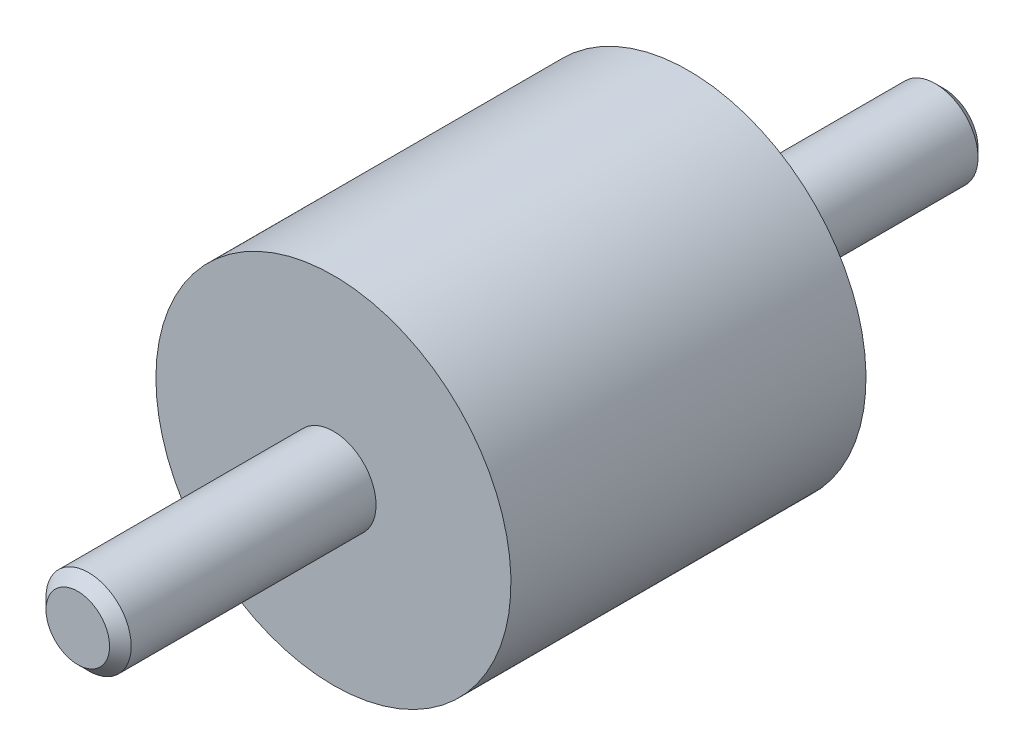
ISO-10303-21;
HEADER;
FILE_DESCRIPTION(('STEP AP214'),'2;1');
FILE_NAME('part.step','',(''),(''),'','','');
FILE_SCHEMA(('AUTOMOTIVE_DESIGN { 1 0 10303 214 1 1 1 1 }'));
ENDSEC;
DATA;
#1=APPLICATION_CONTEXT('core data for automotive mechanical design processes');
#2=APPLICATION_PROTOCOL_DEFINITION('international standard','automotive_design',2000,#1);
#3=PRODUCT_CONTEXT('',#1,'mechanical');
#4=PRODUCT('Part','Part','',(#3));
#5=PRODUCT_RELATED_PRODUCT_CATEGORY('part','',(#4));
#6=PRODUCT_DEFINITION_FORMATION('','',#4);
#7=PRODUCT_DEFINITION_CONTEXT('part definition',#1,'design');
#8=PRODUCT_DEFINITION('design','',#6,#7);
#9=PRODUCT_DEFINITION_SHAPE('','',#8);
#10=(LENGTH_UNIT() NAMED_UNIT(*) SI_UNIT(.MILLI.,.METRE.));
#11=(NAMED_UNIT(*) PLANE_ANGLE_UNIT() SI_UNIT($,.RADIAN.));
#12=(NAMED_UNIT(*) SI_UNIT($,.STERADIAN.) SOLID_ANGLE_UNIT());
#13=UNCERTAINTY_MEASURE_WITH_UNIT(LENGTH_MEASURE(1.E-05),#10,'distance_accuracy_value','');
#14=(GEOMETRIC_REPRESENTATION_CONTEXT(3) GLOBAL_UNCERTAINTY_ASSIGNED_CONTEXT((#13)) GLOBAL_UNIT_ASSIGNED_CONTEXT((#10,
#11,#12)) REPRESENTATION_CONTEXT('',''));
#15=CARTESIAN_POINT('',(0.,0.,0.));
#16=DIRECTION('',(0.,0.,1.));
#17=DIRECTION('',(1.,0.,0.));
#18=AXIS2_PLACEMENT_3D('',#15,#16,#17);
#19=CARTESIAN_POINT('',(0.,0.,0.5));
#20=DIRECTION('',(0.,0.,1.));
#21=DIRECTION('',(0.,-1.,0.));
#22=AXIS2_PLACEMENT_3D('',#19,#20,#21);
#23=CYLINDRICAL_SURFACE('',#22,12.5);
#24=CARTESIAN_POINT('',(0.,0.,0.));
#25=DIRECTION('',(0.,0.,1.));
#26=DIRECTION('',(0.,-1.,0.));
#27=AXIS2_PLACEMENT_3D('',#24,#25,#26);
#28=CIRCLE('',#27,12.5);
#29=CARTESIAN_POINT('',(0.,-12.5,0.));
#30=VERTEX_POINT('',#29);
#31=EDGE_CURVE('E22',#30,#30,#28,.T.);
#32=ORIENTED_EDGE('',*,*,#31,.T.);
#33=EDGE_LOOP('',(#32));
#34=FACE_BOUND('',#33,.T.);
#35=CARTESIAN_POINT('',(0.,0.,25.));
#36=DIRECTION('',(0.,0.,-1.));
#37=DIRECTION('',(-1.,0.,0.));
#38=AXIS2_PLACEMENT_3D('',#35,#36,#37);
#39=CIRCLE('',#38,12.5);
#40=CARTESIAN_POINT('',(-12.5,0.,25.));
#41=VERTEX_POINT('',#40);
#42=EDGE_CURVE('E34',#41,#41,#39,.T.);
#43=ORIENTED_EDGE('',*,*,#42,.T.);
#44=EDGE_LOOP('',(#43));
#45=FACE_BOUND('',#44,.T.);
#46=ADVANCED_FACE('F12',(#34,#45),#23,.T.);
#47=CARTESIAN_POINT('',(12.5,0.,0.));
#48=DIRECTION('',(0.,0.,-1.));
#49=DIRECTION('',(0.,1.,0.));
#50=AXIS2_PLACEMENT_3D('',#47,#48,#49);
#51=PLANE('',#50);
#52=CARTESIAN_POINT('',(0.,0.,0.));
#53=DIRECTION('',(0.,0.,-1.));
#54=DIRECTION('',(0.,1.,0.));
#55=AXIS2_PLACEMENT_3D('',#52,#53,#54);
#56=CIRCLE('',#55,3.);
#57=CARTESIAN_POINT('',(0.,3.,0.));
#58=VERTEX_POINT('',#57);
#59=EDGE_CURVE('E18',#58,#58,#56,.T.);
#60=ORIENTED_EDGE('',*,*,#59,.F.);
#61=EDGE_LOOP('',(#60));
#62=FACE_BOUND('',#61,.T.);
#63=ORIENTED_EDGE('',*,*,#31,.F.);
#64=EDGE_LOOP('',(#63));
#65=FACE_BOUND('',#64,.T.);
#66=ADVANCED_FACE('F57',(#62,#65),#51,.T.);
#67=CARTESIAN_POINT('',(0.,0.,-18.));
#68=DIRECTION('',(0.,0.,1.));
#69=DIRECTION('',(0.,-1.,0.));
#70=AXIS2_PLACEMENT_3D('',#67,#68,#69);
#71=CYLINDRICAL_SURFACE('',#70,3.);
#72=CARTESIAN_POINT('',(0.,0.,-17.3865));
#73=DIRECTION('',(0.,0.,1.));
#74=DIRECTION('',(0.,-1.,0.));
#75=AXIS2_PLACEMENT_3D('',#72,#73,#74);
#76=CIRCLE('',#75,3.);
#77=CARTESIAN_POINT('',(0.,-3.,-17.3865));
#78=VERTEX_POINT('',#77);
#79=EDGE_CURVE('E26',#78,#78,#76,.T.);
#80=ORIENTED_EDGE('',*,*,#79,.T.);
#81=EDGE_LOOP('',(#80));
#82=FACE_BOUND('',#81,.T.);
#83=ORIENTED_EDGE('',*,*,#59,.T.);
#84=EDGE_LOOP('',(#83));
#85=FACE_BOUND('',#84,.T.);
#86=ADVANCED_FACE('F62',(#82,#85),#71,.T.);
#87=CARTESIAN_POINT('',(0.,0.,-17.3865));
#88=DIRECTION('',(0.,0.,1.));
#89=DIRECTION('',(0.,-1.,0.));
#90=AXIS2_PLACEMENT_3D('',#87,#88,#89);
#91=CONICAL_SURFACE('',#90,3.,0.785398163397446);
#92=CARTESIAN_POINT('',(0.,0.,-18.));
#93=DIRECTION('',(0.,0.,1.));
#94=DIRECTION('',(0.,-1.,0.));
#95=AXIS2_PLACEMENT_3D('',#92,#93,#94);
#96=CIRCLE('',#95,2.3865);
#97=CARTESIAN_POINT('',(0.,-2.3865,-18.));
#98=VERTEX_POINT('',#97);
#99=EDGE_CURVE('E31',#98,#98,#96,.T.);
#100=ORIENTED_EDGE('',*,*,#99,.T.);
#101=EDGE_LOOP('',(#100));
#102=FACE_BOUND('',#101,.T.);
#103=ORIENTED_EDGE('',*,*,#79,.F.);
#104=EDGE_LOOP('',(#103));
#105=FACE_BOUND('',#104,.T.);
#106=ADVANCED_FACE('F78',(#102,#105),#91,.T.);
#107=CARTESIAN_POINT('',(2.3865,0.,-18.));
#108=DIRECTION('',(0.,0.,-1.));
#109=DIRECTION('',(0.,1.,0.));
#110=AXIS2_PLACEMENT_3D('',#107,#108,#109);
#111=PLANE('',#110);
#112=ORIENTED_EDGE('',*,*,#99,.F.);
#113=EDGE_LOOP('',(#112));
#114=FACE_BOUND('',#113,.T.);
#115=ADVANCED_FACE('F70',(#114),#111,.T.);
#116=CARTESIAN_POINT('',(0.,12.5,25.));
#117=DIRECTION('',(0.,0.,1.));
#118=DIRECTION('',(1.,0.,0.));
#119=AXIS2_PLACEMENT_3D('',#116,#117,#118);
#120=PLANE('',#119);
#121=CARTESIAN_POINT('',(0.,0.,25.));
#122=DIRECTION('',(0.,0.,1.));
#123=DIRECTION('',(1.,0.,0.));
#124=AXIS2_PLACEMENT_3D('',#121,#122,#123);
#125=CIRCLE('',#124,3.);
#126=CARTESIAN_POINT('',(3.,0.,25.));
#127=VERTEX_POINT('',#126);
#128=EDGE_CURVE('E8',#127,#127,#125,.F.);
#129=ORIENTED_EDGE('',*,*,#128,.T.);
#130=EDGE_LOOP('',(#129));
#131=FACE_BOUND('',#130,.T.);
#132=ORIENTED_EDGE('',*,*,#42,.F.);
#133=EDGE_LOOP('',(#132));
#134=FACE_BOUND('',#133,.T.);
#135=ADVANCED_FACE('F68',(#131,#134),#120,.T.);
#136=CARTESIAN_POINT('',(0.,0.,15.));
#137=DIRECTION('',(0.,0.,1.));
#138=DIRECTION('',(0.,-1.,0.));
#139=AXIS2_PLACEMENT_3D('',#136,#137,#138);
#140=CYLINDRICAL_SURFACE('',#139,3.);
#141=ORIENTED_EDGE('',*,*,#128,.F.);
#142=EDGE_LOOP('',(#141));
#143=FACE_BOUND('',#142,.T.);
#144=CARTESIAN_POINT('',(0.,0.,42.2385265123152));
#145=DIRECTION('',(0.,0.,-1.));
#146=DIRECTION('',(-1.,0.,0.));
#147=AXIS2_PLACEMENT_3D('',#144,#145,#146);
#148=CIRCLE('',#147,3.);
#149=CARTESIAN_POINT('',(-3.,0.,42.2385265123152));
#150=VERTEX_POINT('',#149);
#151=EDGE_CURVE('E37',#150,#150,#148,.T.);
#152=ORIENTED_EDGE('',*,*,#151,.T.);
#153=EDGE_LOOP('',(#152));
#154=FACE_BOUND('',#153,.T.);
#155=ADVANCED_FACE('F54',(#143,#154),#140,.T.);
#156=CARTESIAN_POINT('',(0.,0.,42.2385265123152));
#157=DIRECTION('',(0.,0.,-1.));
#158=DIRECTION('',(-1.,0.,0.));
#159=AXIS2_PLACEMENT_3D('',#156,#157,#158);
#160=CONICAL_SURFACE('',#159,3.,0.785398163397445);
#161=CARTESIAN_POINT('',(0.,0.,43.));
#162=DIRECTION('',(0.,0.,-1.));
#163=DIRECTION('',(-1.,0.,0.));
#164=AXIS2_PLACEMENT_3D('',#161,#162,#163);
#165=CIRCLE('',#164,2.23852651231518);
#166=CARTESIAN_POINT('',(-2.23852651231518,0.,43.));
#167=VERTEX_POINT('',#166);
#168=EDGE_CURVE('E40',#167,#167,#165,.T.);
#169=ORIENTED_EDGE('',*,*,#168,.T.);
#170=EDGE_LOOP('',(#169));
#171=FACE_BOUND('',#170,.T.);
#172=ORIENTED_EDGE('',*,*,#151,.F.);
#173=EDGE_LOOP('',(#172));
#174=FACE_BOUND('',#173,.T.);
#175=ADVANCED_FACE('F44',(#171,#174),#160,.T.);
#176=CARTESIAN_POINT('',(0.,2.23852651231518,43.));
#177=DIRECTION('',(0.,0.,1.));
#178=DIRECTION('',(1.,0.,0.));
#179=AXIS2_PLACEMENT_3D('',#176,#177,#178);
#180=PLANE('',#179);
#181=ORIENTED_EDGE('',*,*,#168,.F.);
#182=EDGE_LOOP('',(#181));
#183=FACE_BOUND('',#182,.T.);
#184=ADVANCED_FACE('F47',(#183),#180,.T.);
#185=CLOSED_SHELL('',(#46,#66,#86,#106,#115,#135,#155,#175,#184));
#186=MANIFOLD_SOLID_BREP('B1',#185);
#187=ADVANCED_BREP_SHAPE_REPRESENTATION('',(#18,#186),#14);
#188=SHAPE_DEFINITION_REPRESENTATION(#9,#187);
ENDSEC;
END-ISO-10303-21;
